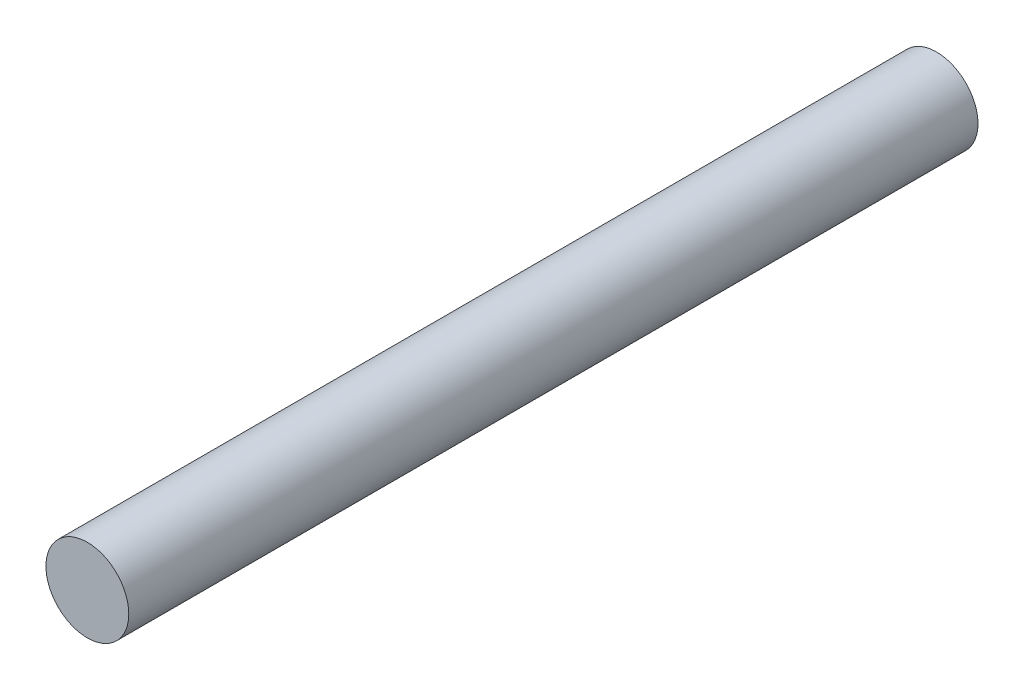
ISO-10303-21;
HEADER;
FILE_DESCRIPTION(('STEP AP214'),'2;1');
FILE_NAME('part.step','',(''),(''),'','','');
FILE_SCHEMA(('AUTOMOTIVE_DESIGN { 1 0 10303 214 1 1 1 1 }'));
ENDSEC;
DATA;
#1=APPLICATION_CONTEXT('core data for automotive mechanical design processes');
#2=APPLICATION_PROTOCOL_DEFINITION('international standard','automotive_design',2000,#1);
#3=PRODUCT_CONTEXT('',#1,'mechanical');
#4=PRODUCT('Part','Part','',(#3));
#5=PRODUCT_RELATED_PRODUCT_CATEGORY('part','',(#4));
#6=PRODUCT_DEFINITION_FORMATION('','',#4);
#7=PRODUCT_DEFINITION_CONTEXT('part definition',#1,'design');
#8=PRODUCT_DEFINITION('design','',#6,#7);
#9=PRODUCT_DEFINITION_SHAPE('','',#8);
#10=(LENGTH_UNIT() NAMED_UNIT(*) SI_UNIT(.MILLI.,.METRE.));
#11=(NAMED_UNIT(*) PLANE_ANGLE_UNIT() SI_UNIT($,.RADIAN.));
#12=(NAMED_UNIT(*) SI_UNIT($,.STERADIAN.) SOLID_ANGLE_UNIT());
#13=UNCERTAINTY_MEASURE_WITH_UNIT(LENGTH_MEASURE(1.E-05),#10,'distance_accuracy_value','');
#14=(GEOMETRIC_REPRESENTATION_CONTEXT(3) GLOBAL_UNCERTAINTY_ASSIGNED_CONTEXT((#13)) GLOBAL_UNIT_ASSIGNED_CONTEXT((#10,
#11,#12)) REPRESENTATION_CONTEXT('',''));
#15=CARTESIAN_POINT('',(0.,0.,0.));
#16=DIRECTION('',(0.,0.,1.));
#17=DIRECTION('',(1.,0.,0.));
#18=AXIS2_PLACEMENT_3D('',#15,#16,#17);
#19=CARTESIAN_POINT('',(0.,0.,82.));
#20=DIRECTION('',(0.,0.,-1.));
#21=DIRECTION('',(-1.,0.,0.));
#22=AXIS2_PLACEMENT_3D('',#19,#20,#21);
#23=CYLINDRICAL_SURFACE('',#22,4.);
#24=CARTESIAN_POINT('',(0.,0.,82.));
#25=DIRECTION('',(0.,0.,1.));
#26=DIRECTION('',(1.,0.,0.));
#27=AXIS2_PLACEMENT_3D('',#24,#25,#26);
#28=CIRCLE('',#27,4.);
#29=CARTESIAN_POINT('',(4.,0.,82.));
#30=VERTEX_POINT('',#29);
#31=EDGE_CURVE('E10',#30,#30,#28,.T.);
#32=ORIENTED_EDGE('',*,*,#31,.F.);
#33=EDGE_LOOP('',(#32));
#34=FACE_BOUND('',#33,.T.);
#35=CARTESIAN_POINT('',(0.,0.,0.));
#36=DIRECTION('',(0.,0.,1.));
#37=DIRECTION('',(1.,0.,0.));
#38=AXIS2_PLACEMENT_3D('',#35,#36,#37);
#39=CIRCLE('',#38,4.);
#40=CARTESIAN_POINT('',(4.,0.,0.));
#41=VERTEX_POINT('',#40);
#42=EDGE_CURVE('E33',#41,#41,#39,.T.);
#43=ORIENTED_EDGE('',*,*,#42,.T.);
#44=EDGE_LOOP('',(#43));
#45=FACE_BOUND('',#44,.T.);
#46=ADVANCED_FACE('F30',(#34,#45),#23,.T.);
#47=CARTESIAN_POINT('',(0.,0.,82.));
#48=DIRECTION('',(0.,0.,1.));
#49=DIRECTION('',(1.,0.,0.));
#50=AXIS2_PLACEMENT_3D('',#47,#48,#49);
#51=PLANE('',#50);
#52=ORIENTED_EDGE('',*,*,#31,.T.);
#53=EDGE_LOOP('',(#52));
#54=FACE_BOUND('',#53,.T.);
#55=ADVANCED_FACE('F45',(#54),#51,.T.);
#56=CARTESIAN_POINT('',(0.,0.,0.));
#57=DIRECTION('',(0.,0.,1.));
#58=DIRECTION('',(1.,0.,0.));
#59=AXIS2_PLACEMENT_3D('',#56,#57,#58);
#60=PLANE('',#59);
#61=ORIENTED_EDGE('',*,*,#42,.F.);
#62=EDGE_LOOP('',(#61));
#63=FACE_BOUND('',#62,.T.);
#64=ADVANCED_FACE('F43',(#63),#60,.F.);
#65=CLOSED_SHELL('',(#46,#55,#64));
#66=MANIFOLD_SOLID_BREP('B2',#65);
#67=ADVANCED_BREP_SHAPE_REPRESENTATION('',(#18,#66),#14);
#68=SHAPE_DEFINITION_REPRESENTATION(#9,#67);
ENDSEC;
END-ISO-10303-21;
